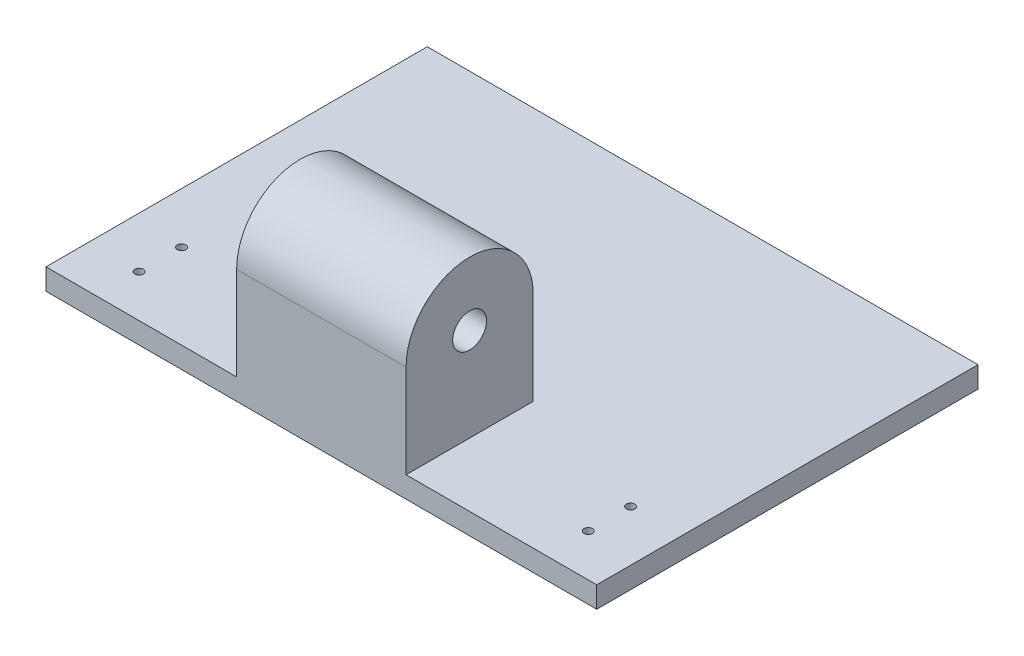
ISO-10303-21;
HEADER;
FILE_DESCRIPTION(('STEP AP214'),'2;1');
FILE_NAME('part.step','',(''),(''),'','','');
FILE_SCHEMA(('AUTOMOTIVE_DESIGN { 1 0 10303 214 1 1 1 1 }'));
ENDSEC;
DATA;
#1=APPLICATION_CONTEXT('core data for automotive mechanical design processes');
#2=APPLICATION_PROTOCOL_DEFINITION('international standard','automotive_design',2000,#1);
#3=PRODUCT_CONTEXT('',#1,'mechanical');
#4=PRODUCT('Part','Part','',(#3));
#5=PRODUCT_RELATED_PRODUCT_CATEGORY('part','',(#4));
#6=PRODUCT_DEFINITION_FORMATION('','',#4);
#7=PRODUCT_DEFINITION_CONTEXT('part definition',#1,'design');
#8=PRODUCT_DEFINITION('design','',#6,#7);
#9=PRODUCT_DEFINITION_SHAPE('','',#8);
#10=(LENGTH_UNIT() NAMED_UNIT(*) SI_UNIT(.MILLI.,.METRE.));
#11=(NAMED_UNIT(*) PLANE_ANGLE_UNIT() SI_UNIT($,.RADIAN.));
#12=(NAMED_UNIT(*) SI_UNIT($,.STERADIAN.) SOLID_ANGLE_UNIT());
#13=UNCERTAINTY_MEASURE_WITH_UNIT(LENGTH_MEASURE(1.E-05),#10,'distance_accuracy_value','');
#14=(GEOMETRIC_REPRESENTATION_CONTEXT(3) GLOBAL_UNCERTAINTY_ASSIGNED_CONTEXT((#13)) GLOBAL_UNIT_ASSIGNED_CONTEXT((#10,
#11,#12)) REPRESENTATION_CONTEXT('',''));
#15=CARTESIAN_POINT('',(0.,0.,0.));
#16=DIRECTION('',(0.,0.,1.));
#17=DIRECTION('',(1.,0.,0.));
#18=AXIS2_PLACEMENT_3D('',#15,#16,#17);
#19=CARTESIAN_POINT('',(40.,0.,-15.));
#20=DIRECTION('',(0.,0.,-1.));
#21=DIRECTION('',(0.,1.,0.));
#22=AXIS2_PLACEMENT_3D('',#19,#20,#21);
#23=PLANE('',#22);
#24=DIRECTION('',(0.,-1.,0.));
#25=VECTOR('',#24,1.);
#26=CARTESIAN_POINT('',(40.,0.,-15.));
#27=LINE('',#26,#25);
#28=CARTESIAN_POINT('',(40.,0.,-15.));
#29=VERTEX_POINT('',#28);
#30=CARTESIAN_POINT('',(40.,-22.,-15.));
#31=VERTEX_POINT('',#30);
#32=EDGE_CURVE('E98',#29,#31,#27,.T.);
#33=ORIENTED_EDGE('',*,*,#32,.T.);
#34=DIRECTION('',(1.,0.,0.));
#35=VECTOR('',#34,1.);
#36=CARTESIAN_POINT('',(85.,-22.,-15.));
#37=LINE('',#36,#35);
#38=CARTESIAN_POINT('',(0.,-22.,-15.));
#39=VERTEX_POINT('',#38);
#40=EDGE_CURVE('E168',#39,#31,#37,.T.);
#41=ORIENTED_EDGE('',*,*,#40,.F.);
#42=DIRECTION('',(0.,-1.,0.));
#43=VECTOR('',#42,1.);
#44=CARTESIAN_POINT('',(0.,0.,-15.));
#45=LINE('',#44,#43);
#46=CARTESIAN_POINT('',(0.,0.,-15.));
#47=VERTEX_POINT('',#46);
#48=EDGE_CURVE('E115',#47,#39,#45,.T.);
#49=ORIENTED_EDGE('',*,*,#48,.F.);
#50=DIRECTION('',(-1.,0.,0.));
#51=VECTOR('',#50,1.);
#52=CARTESIAN_POINT('',(40.,0.,-15.));
#53=LINE('',#52,#51);
#54=EDGE_CURVE('E46',#29,#47,#53,.T.);
#55=ORIENTED_EDGE('',*,*,#54,.F.);
#56=EDGE_LOOP('',(#33,#41,#49,#55));
#57=FACE_BOUND('',#56,.T.);
#58=ADVANCED_FACE('F37',(#57),#23,.T.);
#59=CARTESIAN_POINT('',(40.,0.,0.));
#60=DIRECTION('',(-1.,0.,0.));
#61=DIRECTION('',(0.,0.,1.));
#62=AXIS2_PLACEMENT_3D('',#59,#60,#61);
#63=CYLINDRICAL_SURFACE('',#62,15.);
#64=CARTESIAN_POINT('',(0.,0.,0.));
#65=DIRECTION('',(1.,0.,0.));
#66=DIRECTION('',(0.,0.,-1.));
#67=AXIS2_PLACEMENT_3D('',#64,#65,#66);
#68=CIRCLE('',#67,15.);
#69=CARTESIAN_POINT('',(0.,0.,15.));
#70=VERTEX_POINT('',#69);
#71=EDGE_CURVE('E102',#47,#70,#68,.T.);
#72=ORIENTED_EDGE('',*,*,#71,.T.);
#73=DIRECTION('',(-1.,0.,0.));
#74=VECTOR('',#73,1.);
#75=CARTESIAN_POINT('',(40.,0.,15.));
#76=LINE('',#75,#74);
#77=CARTESIAN_POINT('',(40.,0.,15.));
#78=VERTEX_POINT('',#77);
#79=EDGE_CURVE('E11',#78,#70,#76,.T.);
#80=ORIENTED_EDGE('',*,*,#79,.F.);
#81=CARTESIAN_POINT('',(40.,0.,0.));
#82=DIRECTION('',(1.,0.,0.));
#83=DIRECTION('',(0.,0.,-1.));
#84=AXIS2_PLACEMENT_3D('',#81,#82,#83);
#85=CIRCLE('',#84,15.);
#86=EDGE_CURVE('E93',#29,#78,#85,.T.);
#87=ORIENTED_EDGE('',*,*,#86,.F.);
#88=ORIENTED_EDGE('',*,*,#54,.T.);
#89=EDGE_LOOP('',(#72,#80,#87,#88));
#90=FACE_BOUND('',#89,.T.);
#91=ADVANCED_FACE('F39',(#90),#63,.T.);
#92=CARTESIAN_POINT('',(40.,0.,15.));
#93=DIRECTION('',(0.,0.,-1.));
#94=DIRECTION('',(0.,1.,0.));
#95=AXIS2_PLACEMENT_3D('',#92,#93,#94);
#96=PLANE('',#95);
#97=DIRECTION('',(0.,-1.,0.));
#98=VECTOR('',#97,1.);
#99=CARTESIAN_POINT('',(0.,0.,15.));
#100=LINE('',#99,#98);
#101=CARTESIAN_POINT('',(0.,-22.,15.));
#102=VERTEX_POINT('',#101);
#103=EDGE_CURVE('E66',#70,#102,#100,.T.);
#104=ORIENTED_EDGE('',*,*,#103,.T.);
#105=DIRECTION('',(-1.,0.,0.));
#106=VECTOR('',#105,1.);
#107=CARTESIAN_POINT('',(85.,-22.,15.));
#108=LINE('',#107,#106);
#109=CARTESIAN_POINT('',(-45.,-22.,15.));
#110=VERTEX_POINT('',#109);
#111=EDGE_CURVE('E74',#102,#110,#108,.T.);
#112=ORIENTED_EDGE('',*,*,#111,.T.);
#113=DIRECTION('',(0.,1.,0.));
#114=VECTOR('',#113,1.);
#115=CARTESIAN_POINT('',(-45.,-27.,15.));
#116=LINE('',#115,#114);
#117=CARTESIAN_POINT('',(-45.,-27.,15.));
#118=VERTEX_POINT('',#117);
#119=EDGE_CURVE('E108',#118,#110,#116,.T.);
#120=ORIENTED_EDGE('',*,*,#119,.F.);
#121=DIRECTION('',(-1.,0.,0.));
#122=VECTOR('',#121,1.);
#123=CARTESIAN_POINT('',(85.,-27.,15.));
#124=LINE('',#123,#122);
#125=CARTESIAN_POINT('',(85.,-27.,15.));
#126=VERTEX_POINT('',#125);
#127=EDGE_CURVE('E139',#126,#118,#124,.T.);
#128=ORIENTED_EDGE('',*,*,#127,.F.);
#129=DIRECTION('',(0.,1.,0.));
#130=VECTOR('',#129,1.);
#131=CARTESIAN_POINT('',(85.,-27.,15.));
#132=LINE('',#131,#130);
#133=CARTESIAN_POINT('',(85.,-22.,15.));
#134=VERTEX_POINT('',#133);
#135=EDGE_CURVE('E104',#126,#134,#132,.T.);
#136=ORIENTED_EDGE('',*,*,#135,.T.);
#137=CARTESIAN_POINT('',(40.,-22.,15.));
#138=VERTEX_POINT('',#137);
#139=EDGE_CURVE('E90',#134,#138,#108,.T.);
#140=ORIENTED_EDGE('',*,*,#139,.T.);
#141=DIRECTION('',(0.,-1.,0.));
#142=VECTOR('',#141,1.);
#143=CARTESIAN_POINT('',(40.,0.,15.));
#144=LINE('',#143,#142);
#145=EDGE_CURVE('E83',#78,#138,#144,.T.);
#146=ORIENTED_EDGE('',*,*,#145,.F.);
#147=ORIENTED_EDGE('',*,*,#79,.T.);
#148=EDGE_LOOP('',(#104,#112,#120,#128,#136,#140,#146,#147));
#149=FACE_BOUND('',#148,.T.);
#150=ADVANCED_FACE('F85',(#149),#96,.F.);
#151=CARTESIAN_POINT('',(40.,0.,0.));
#152=DIRECTION('',(-1.,0.,0.));
#153=DIRECTION('',(0.,0.,1.));
#154=AXIS2_PLACEMENT_3D('',#151,#152,#153);
#155=CYLINDRICAL_SURFACE('',#154,4.);
#156=CARTESIAN_POINT('',(40.,0.,0.));
#157=DIRECTION('',(1.,0.,0.));
#158=DIRECTION('',(0.,0.,-1.));
#159=AXIS2_PLACEMENT_3D('',#156,#157,#158);
#160=CIRCLE('',#159,4.);
#161=CARTESIAN_POINT('',(40.,0.,-4.));
#162=VERTEX_POINT('',#161);
#163=EDGE_CURVE('E111',#162,#162,#160,.T.);
#164=ORIENTED_EDGE('',*,*,#163,.T.);
#165=EDGE_LOOP('',(#164));
#166=FACE_BOUND('',#165,.T.);
#167=CARTESIAN_POINT('',(0.,0.,0.));
#168=DIRECTION('',(1.,0.,0.));
#169=DIRECTION('',(0.,0.,-1.));
#170=AXIS2_PLACEMENT_3D('',#167,#168,#169);
#171=CIRCLE('',#170,4.);
#172=CARTESIAN_POINT('',(0.,0.,-4.));
#173=VERTEX_POINT('',#172);
#174=EDGE_CURVE('E100',#173,#173,#171,.T.);
#175=ORIENTED_EDGE('',*,*,#174,.F.);
#176=EDGE_LOOP('',(#175));
#177=FACE_BOUND('',#176,.T.);
#178=ADVANCED_FACE('F216',(#166,#177),#155,.F.);
#179=CARTESIAN_POINT('',(40.,0.,0.));
#180=DIRECTION('',(1.,0.,0.));
#181=DIRECTION('',(0.,0.,-1.));
#182=AXIS2_PLACEMENT_3D('',#179,#180,#181);
#183=PLANE('',#182);
#184=ORIENTED_EDGE('',*,*,#86,.T.);
#185=ORIENTED_EDGE('',*,*,#145,.T.);
#186=DIRECTION('',(0.,0.,-1.));
#187=VECTOR('',#186,1.);
#188=CARTESIAN_POINT('',(40.,-22.,0.));
#189=LINE('',#188,#187);
#190=EDGE_CURVE('E92',#138,#31,#189,.T.);
#191=ORIENTED_EDGE('',*,*,#190,.T.);
#192=ORIENTED_EDGE('',*,*,#32,.F.);
#193=EDGE_LOOP('',(#184,#185,#191,#192));
#194=FACE_BOUND('',#193,.T.);
#195=ORIENTED_EDGE('',*,*,#163,.F.);
#196=EDGE_LOOP('',(#195));
#197=FACE_BOUND('',#196,.T.);
#198=ADVANCED_FACE('F96',(#194,#197),#183,.T.);
#199=CARTESIAN_POINT('',(0.,0.,0.));
#200=DIRECTION('',(1.,0.,0.));
#201=DIRECTION('',(0.,0.,-1.));
#202=AXIS2_PLACEMENT_3D('',#199,#200,#201);
#203=PLANE('',#202);
#204=ORIENTED_EDGE('',*,*,#71,.F.);
#205=ORIENTED_EDGE('',*,*,#48,.T.);
#206=DIRECTION('',(0.,0.,-1.));
#207=VECTOR('',#206,1.);
#208=CARTESIAN_POINT('',(0.,-22.,0.));
#209=LINE('',#208,#207);
#210=EDGE_CURVE('E106',#102,#39,#209,.T.);
#211=ORIENTED_EDGE('',*,*,#210,.F.);
#212=ORIENTED_EDGE('',*,*,#103,.F.);
#213=EDGE_LOOP('',(#204,#205,#211,#212));
#214=FACE_BOUND('',#213,.T.);
#215=ORIENTED_EDGE('',*,*,#174,.T.);
#216=EDGE_LOOP('',(#215));
#217=FACE_BOUND('',#216,.T.);
#218=ADVANCED_FACE('F210',(#214,#217),#203,.F.);
#219=CARTESIAN_POINT('',(0.,-22.,0.));
#220=DIRECTION('',(0.,-1.,0.));
#221=DIRECTION('',(0.,0.,-1.));
#222=AXIS2_PLACEMENT_3D('',#219,#220,#221);
#223=PLANE('',#222);
#224=CARTESIAN_POINT('',(-33.0223912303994,-22.,4.99997493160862));
#225=DIRECTION('',(0.,-1.,0.));
#226=DIRECTION('',(0.,0.,-1.));
#227=AXIS2_PLACEMENT_3D('',#224,#225,#226);
#228=CIRCLE('',#227,0.999999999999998);
#229=CARTESIAN_POINT('',(-33.0223912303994,-22.,3.99997493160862));
#230=VERTEX_POINT('',#229);
#231=EDGE_CURVE('E158',#230,#230,#228,.F.);
#232=ORIENTED_EDGE('',*,*,#231,.F.);
#233=EDGE_LOOP('',(#232));
#234=FACE_BOUND('',#233,.T.);
#235=CARTESIAN_POINT('',(-33.,-22.,-5.00000000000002));
#236=DIRECTION('',(0.,-1.,0.));
#237=DIRECTION('',(0.,0.,-1.));
#238=AXIS2_PLACEMENT_3D('',#235,#236,#237);
#239=CIRCLE('',#238,0.999999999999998);
#240=CARTESIAN_POINT('',(-33.,-22.,-6.00000000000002));
#241=VERTEX_POINT('',#240);
#242=EDGE_CURVE('E150',#241,#241,#239,.F.);
#243=ORIENTED_EDGE('',*,*,#242,.F.);
#244=EDGE_LOOP('',(#243));
#245=FACE_BOUND('',#244,.T.);
#246=ORIENTED_EDGE('',*,*,#111,.F.);
#247=ORIENTED_EDGE('',*,*,#210,.T.);
#248=ORIENTED_EDGE('',*,*,#40,.T.);
#249=ORIENTED_EDGE('',*,*,#190,.F.);
#250=ORIENTED_EDGE('',*,*,#139,.F.);
#251=DIRECTION('',(0.,0.,1.));
#252=VECTOR('',#251,1.);
#253=CARTESIAN_POINT('',(85.,-22.,-15.));
#254=LINE('',#253,#252);
#255=CARTESIAN_POINT('',(85.,-22.,-75.));
#256=VERTEX_POINT('',#255);
#257=EDGE_CURVE('E133',#256,#134,#254,.T.);
#258=ORIENTED_EDGE('',*,*,#257,.F.);
#259=DIRECTION('',(1.,0.,0.));
#260=VECTOR('',#259,1.);
#261=CARTESIAN_POINT('',(85.,-22.,-75.));
#262=LINE('',#261,#260);
#263=CARTESIAN_POINT('',(-45.,-22.,-75.));
#264=VERTEX_POINT('',#263);
#265=EDGE_CURVE('E157',#264,#256,#262,.T.);
#266=ORIENTED_EDGE('',*,*,#265,.F.);
#267=DIRECTION('',(0.,0.,-1.));
#268=VECTOR('',#267,1.);
#269=CARTESIAN_POINT('',(-45.,-22.,-15.));
#270=LINE('',#269,#268);
#271=EDGE_CURVE('E128',#110,#264,#270,.T.);
#272=ORIENTED_EDGE('',*,*,#271,.F.);
#273=EDGE_LOOP('',(#246,#247,#248,#249,#250,#258,#266,#272));
#274=FACE_BOUND('',#273,.T.);
#275=CARTESIAN_POINT('',(73.,-22.,-5.00000000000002));
#276=DIRECTION('',(0.,-1.,0.));
#277=DIRECTION('',(0.,0.,-1.));
#278=AXIS2_PLACEMENT_3D('',#275,#276,#277);
#279=CIRCLE('',#278,0.999999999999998);
#280=CARTESIAN_POINT('',(73.,-22.,-6.00000000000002));
#281=VERTEX_POINT('',#280);
#282=EDGE_CURVE('E149',#281,#281,#279,.F.);
#283=ORIENTED_EDGE('',*,*,#282,.F.);
#284=EDGE_LOOP('',(#283));
#285=FACE_BOUND('',#284,.T.);
#286=CARTESIAN_POINT('',(73.,-22.,4.99999999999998));
#287=DIRECTION('',(0.,-1.,0.));
#288=DIRECTION('',(0.,0.,-1.));
#289=AXIS2_PLACEMENT_3D('',#286,#287,#288);
#290=CIRCLE('',#289,0.999999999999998);
#291=CARTESIAN_POINT('',(73.,-22.,3.99999999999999));
#292=VERTEX_POINT('',#291);
#293=EDGE_CURVE('E136',#292,#292,#290,.F.);
#294=ORIENTED_EDGE('',*,*,#293,.F.);
#295=EDGE_LOOP('',(#294));
#296=FACE_BOUND('',#295,.T.);
#297=ADVANCED_FACE('F208',(#234,#245,#274,#285,#296),#223,.F.);
#298=CARTESIAN_POINT('',(85.,-27.,-15.));
#299=DIRECTION('',(-1.,0.,0.));
#300=DIRECTION('',(0.,0.,1.));
#301=AXIS2_PLACEMENT_3D('',#298,#299,#300);
#302=PLANE('',#301);
#303=ORIENTED_EDGE('',*,*,#257,.T.);
#304=ORIENTED_EDGE('',*,*,#135,.F.);
#305=DIRECTION('',(0.,0.,1.));
#306=VECTOR('',#305,1.);
#307=CARTESIAN_POINT('',(85.,-27.,-15.));
#308=LINE('',#307,#306);
#309=CARTESIAN_POINT('',(85.,-27.,-75.));
#310=VERTEX_POINT('',#309);
#311=EDGE_CURVE('E131',#310,#126,#308,.T.);
#312=ORIENTED_EDGE('',*,*,#311,.F.);
#313=DIRECTION('',(0.,-1.,0.));
#314=VECTOR('',#313,1.);
#315=CARTESIAN_POINT('',(85.,-27.,-75.));
#316=LINE('',#315,#314);
#317=EDGE_CURVE('E170',#256,#310,#316,.T.);
#318=ORIENTED_EDGE('',*,*,#317,.F.);
#319=EDGE_LOOP('',(#303,#304,#312,#318));
#320=FACE_BOUND('',#319,.T.);
#321=ADVANCED_FACE('F192',(#320),#302,.F.);
#322=CARTESIAN_POINT('',(-45.,-27.,-15.));
#323=DIRECTION('',(1.,0.,0.));
#324=DIRECTION('',(0.,0.,-1.));
#325=AXIS2_PLACEMENT_3D('',#322,#323,#324);
#326=PLANE('',#325);
#327=ORIENTED_EDGE('',*,*,#271,.T.);
#328=DIRECTION('',(0.,1.,0.));
#329=VECTOR('',#328,1.);
#330=CARTESIAN_POINT('',(-45.,-27.,-75.));
#331=LINE('',#330,#329);
#332=CARTESIAN_POINT('',(-45.,-27.,-75.));
#333=VERTEX_POINT('',#332);
#334=EDGE_CURVE('E173',#333,#264,#331,.T.);
#335=ORIENTED_EDGE('',*,*,#334,.F.);
#336=DIRECTION('',(0.,0.,-1.));
#337=VECTOR('',#336,1.);
#338=CARTESIAN_POINT('',(-45.,-27.,-15.));
#339=LINE('',#338,#337);
#340=EDGE_CURVE('E127',#118,#333,#339,.T.);
#341=ORIENTED_EDGE('',*,*,#340,.F.);
#342=ORIENTED_EDGE('',*,*,#119,.T.);
#343=EDGE_LOOP('',(#327,#335,#341,#342));
#344=FACE_BOUND('',#343,.T.);
#345=ADVANCED_FACE('F321',(#344),#326,.F.);
#346=CARTESIAN_POINT('',(0.,-27.,0.));
#347=DIRECTION('',(0.,-1.,0.));
#348=DIRECTION('',(0.,0.,-1.));
#349=AXIS2_PLACEMENT_3D('',#346,#347,#348);
#350=PLANE('',#349);
#351=CARTESIAN_POINT('',(73.,-27.,-5.00000000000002));
#352=DIRECTION('',(0.,-1.,0.));
#353=DIRECTION('',(0.,0.,-1.));
#354=AXIS2_PLACEMENT_3D('',#351,#352,#353);
#355=CIRCLE('',#354,0.999999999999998);
#356=CARTESIAN_POINT('',(73.,-27.,-6.00000000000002));
#357=VERTEX_POINT('',#356);
#358=EDGE_CURVE('E161',#357,#357,#355,.T.);
#359=ORIENTED_EDGE('',*,*,#358,.F.);
#360=EDGE_LOOP('',(#359));
#361=FACE_BOUND('',#360,.T.);
#362=CARTESIAN_POINT('',(-33.0223912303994,-27.,4.99997493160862));
#363=DIRECTION('',(0.,-1.,0.));
#364=DIRECTION('',(0.,0.,-1.));
#365=AXIS2_PLACEMENT_3D('',#362,#363,#364);
#366=CIRCLE('',#365,0.999999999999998);
#367=CARTESIAN_POINT('',(-33.0223912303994,-27.,3.99997493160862));
#368=VERTEX_POINT('',#367);
#369=EDGE_CURVE('E153',#368,#368,#366,.T.);
#370=ORIENTED_EDGE('',*,*,#369,.F.);
#371=EDGE_LOOP('',(#370));
#372=FACE_BOUND('',#371,.T.);
#373=CARTESIAN_POINT('',(-33.,-27.,-5.00000000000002));
#374=DIRECTION('',(0.,-1.,0.));
#375=DIRECTION('',(0.,0.,-1.));
#376=AXIS2_PLACEMENT_3D('',#373,#374,#375);
#377=CIRCLE('',#376,0.999999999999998);
#378=CARTESIAN_POINT('',(-33.,-27.,-6.00000000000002));
#379=VERTEX_POINT('',#378);
#380=EDGE_CURVE('E154',#379,#379,#377,.T.);
#381=ORIENTED_EDGE('',*,*,#380,.F.);
#382=EDGE_LOOP('',(#381));
#383=FACE_BOUND('',#382,.T.);
#384=CARTESIAN_POINT('',(73.,-27.,4.99999999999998));
#385=DIRECTION('',(0.,-1.,0.));
#386=DIRECTION('',(0.,0.,-1.));
#387=AXIS2_PLACEMENT_3D('',#384,#385,#386);
#388=CIRCLE('',#387,0.999999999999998);
#389=CARTESIAN_POINT('',(73.,-27.,3.99999999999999));
#390=VERTEX_POINT('',#389);
#391=EDGE_CURVE('E146',#390,#390,#388,.T.);
#392=ORIENTED_EDGE('',*,*,#391,.F.);
#393=EDGE_LOOP('',(#392));
#394=FACE_BOUND('',#393,.T.);
#395=ORIENTED_EDGE('',*,*,#311,.T.);
#396=ORIENTED_EDGE('',*,*,#127,.T.);
#397=ORIENTED_EDGE('',*,*,#340,.T.);
#398=DIRECTION('',(-1.,0.,0.));
#399=VECTOR('',#398,1.);
#400=CARTESIAN_POINT('',(85.,-27.,-75.));
#401=LINE('',#400,#399);
#402=EDGE_CURVE('E176',#310,#333,#401,.T.);
#403=ORIENTED_EDGE('',*,*,#402,.F.);
#404=EDGE_LOOP('',(#395,#396,#397,#403));
#405=FACE_BOUND('',#404,.T.);
#406=ADVANCED_FACE('F251',(#361,#372,#383,#394,#405),#350,.T.);
#407=CARTESIAN_POINT('',(73.,15.001,4.99999999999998));
#408=DIRECTION('',(0.,-1.,0.));
#409=DIRECTION('',(0.,0.,-1.));
#410=AXIS2_PLACEMENT_3D('',#407,#408,#409);
#411=CYLINDRICAL_SURFACE('',#410,0.999999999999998);
#412=ORIENTED_EDGE('',*,*,#391,.T.);
#413=EDGE_LOOP('',(#412));
#414=FACE_BOUND('',#413,.T.);
#415=ORIENTED_EDGE('',*,*,#293,.T.);
#416=EDGE_LOOP('',(#415));
#417=FACE_BOUND('',#416,.T.);
#418=ADVANCED_FACE('F245',(#414,#417),#411,.F.);
#419=CARTESIAN_POINT('',(73.,15.001,-5.00000000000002));
#420=DIRECTION('',(0.,-1.,0.));
#421=DIRECTION('',(0.,0.,-1.));
#422=AXIS2_PLACEMENT_3D('',#419,#420,#421);
#423=CYLINDRICAL_SURFACE('',#422,0.999999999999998);
#424=ORIENTED_EDGE('',*,*,#358,.T.);
#425=EDGE_LOOP('',(#424));
#426=FACE_BOUND('',#425,.T.);
#427=ORIENTED_EDGE('',*,*,#282,.T.);
#428=EDGE_LOOP('',(#427));
#429=FACE_BOUND('',#428,.T.);
#430=ADVANCED_FACE('F250',(#426,#429),#423,.F.);
#431=CARTESIAN_POINT('',(-33.,15.001,-5.00000000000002));
#432=DIRECTION('',(0.,-1.,0.));
#433=DIRECTION('',(0.,0.,-1.));
#434=AXIS2_PLACEMENT_3D('',#431,#432,#433);
#435=CYLINDRICAL_SURFACE('',#434,0.999999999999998);
#436=ORIENTED_EDGE('',*,*,#380,.T.);
#437=EDGE_LOOP('',(#436));
#438=FACE_BOUND('',#437,.T.);
#439=ORIENTED_EDGE('',*,*,#242,.T.);
#440=EDGE_LOOP('',(#439));
#441=FACE_BOUND('',#440,.T.);
#442=ADVANCED_FACE('F263',(#438,#441),#435,.F.);
#443=CARTESIAN_POINT('',(-33.0223912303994,15.001,4.99997493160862));
#444=DIRECTION('',(0.,-1.,0.));
#445=DIRECTION('',(0.,0.,-1.));
#446=AXIS2_PLACEMENT_3D('',#443,#444,#445);
#447=CYLINDRICAL_SURFACE('',#446,0.999999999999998);
#448=ORIENTED_EDGE('',*,*,#369,.T.);
#449=EDGE_LOOP('',(#448));
#450=FACE_BOUND('',#449,.T.);
#451=ORIENTED_EDGE('',*,*,#231,.T.);
#452=EDGE_LOOP('',(#451));
#453=FACE_BOUND('',#452,.T.);
#454=ADVANCED_FACE('F273',(#450,#453),#447,.F.);
#455=CARTESIAN_POINT('',(0.,0.,-75.));
#456=DIRECTION('',(0.,0.,1.));
#457=DIRECTION('',(1.,0.,0.));
#458=AXIS2_PLACEMENT_3D('',#455,#456,#457);
#459=PLANE('',#458);
#460=ORIENTED_EDGE('',*,*,#317,.T.);
#461=ORIENTED_EDGE('',*,*,#402,.T.);
#462=ORIENTED_EDGE('',*,*,#334,.T.);
#463=ORIENTED_EDGE('',*,*,#265,.T.);
#464=EDGE_LOOP('',(#460,#461,#462,#463));
#465=FACE_BOUND('',#464,.T.);
#466=ADVANCED_FACE('F183',(#465),#459,.F.);
#467=CLOSED_SHELL('',(#58,#91,#150,#178,#198,#218,#297,#321,#345,#406,#418,#430,#442,#454,#466));
#468=MANIFOLD_SOLID_BREP('B2',#467);
#469=ADVANCED_BREP_SHAPE_REPRESENTATION('',(#18,#468),#14);
#470=SHAPE_DEFINITION_REPRESENTATION(#9,#469);
ENDSEC;
END-ISO-10303-21;
